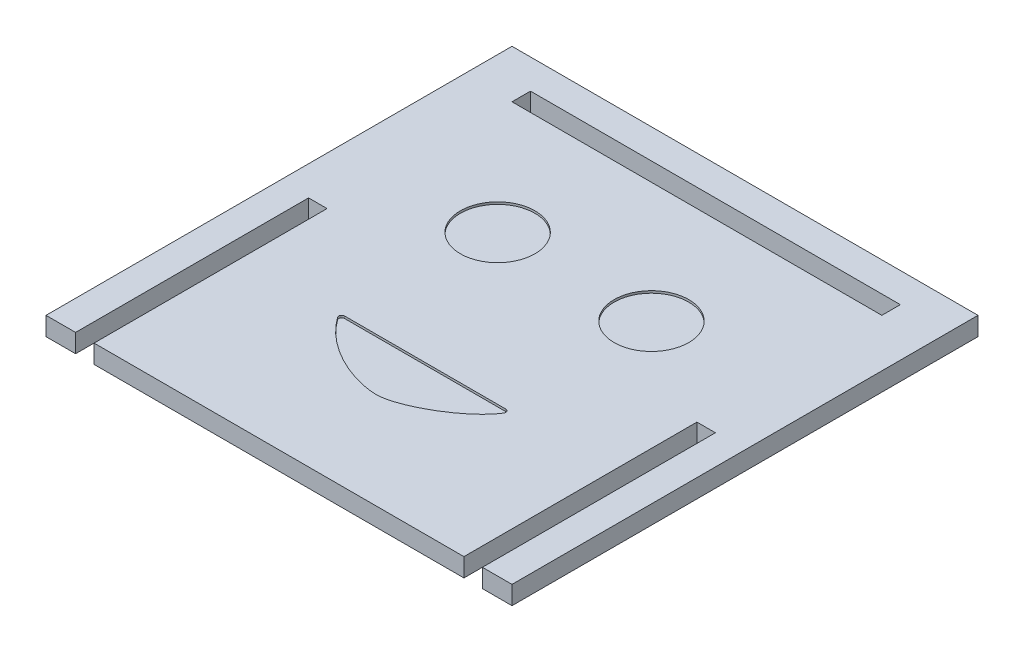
from build123d import *

# Parameters (mm, degrees)
BOSS_EXTRUDE1_DEPTH = 2.5
SKETCH2_R           = 5.041320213
CUT_EXTRUDE1_DEPTH  = 0.3
SKETCH3_W           = 50
SKETCH3_H           = 2.5
CUT_EXTRUDE2_DEPTH  = 45.617821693


with BuildPart() as part:
    # Sketch1 → Boss-Extrude1 (new body)
    with BuildSketch(Plane(origin=(0, 0, 0), x_dir=(1, 0, 0), z_dir=(0, 1, 0))):
        Polygon((-27.5, -31.5), (-27.5, 0), (-25, 0), (-25, -31.5), (25, -31.5), (25, 0), (27.5, 0), (27.5, -31.5), (31.5, -31.5), (31.5, 31.5), (-31.5, 31.5), (-31.5, -31.5), align=None)
    extrude(amount=BOSS_EXTRUDE1_DEPTH)

    # Sketch2 → Cut-Extrude1 (cut)
    with BuildSketch(Plane(origin=(0, 2.5, 0), x_dir=(1, 0, 0), z_dir=(0, 1, 0))):
        with Locations(Location((-10.694101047, 8.755090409, 0), (0, 0, 270))):
            Circle(SKETCH2_R)
        with Locations(Location((10.100283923, 8.755090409, 0), (0, 0, 270))):
            Circle(SKETCH2_R)
        with BuildLine():
            Line((-11.23624116, -11.392314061), (10.543403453, -11.392314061))
            ThreePointArc((10.543403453, -11.392314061), (10.892531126, -11.597096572), (10.884182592, -12.00176472))
            add(Edge.make_bspline(
                [(-11.560754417, -12.026175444), (-8.710905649, -15.980713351), (-3.126818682, -18.372924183), (2.80262271, -18.58501925), (9.137783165, -14.843180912), (10.884182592, -12.00176472)],
                knots=[0.023095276, 0.023095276, 0.023095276, 0.023095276, 0.468250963, 0.563083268, 0.971418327, 0.971418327, 0.971418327, 0.971418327], degree=3))
            ThreePointArc((-11.560754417, -12.026175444), (-11.592292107, -11.61002933), (-11.23624116, -11.392314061))
        make_face()
    extrude(amount=-CUT_EXTRUDE1_DEPTH, mode=Mode.SUBTRACT)

    # Sketch3 → Cut-Extrude2 (cut, through all)
    with BuildSketch(Plane(origin=(0, 2.5, 0), x_dir=(1, 0, 0), z_dir=(0, 1, 0))):
        with Locations((0, 26.25)):
            Rectangle(SKETCH3_W, SKETCH3_H)
    extrude(amount=-CUT_EXTRUDE2_DEPTH, mode=Mode.SUBTRACT)


solid = part.part
